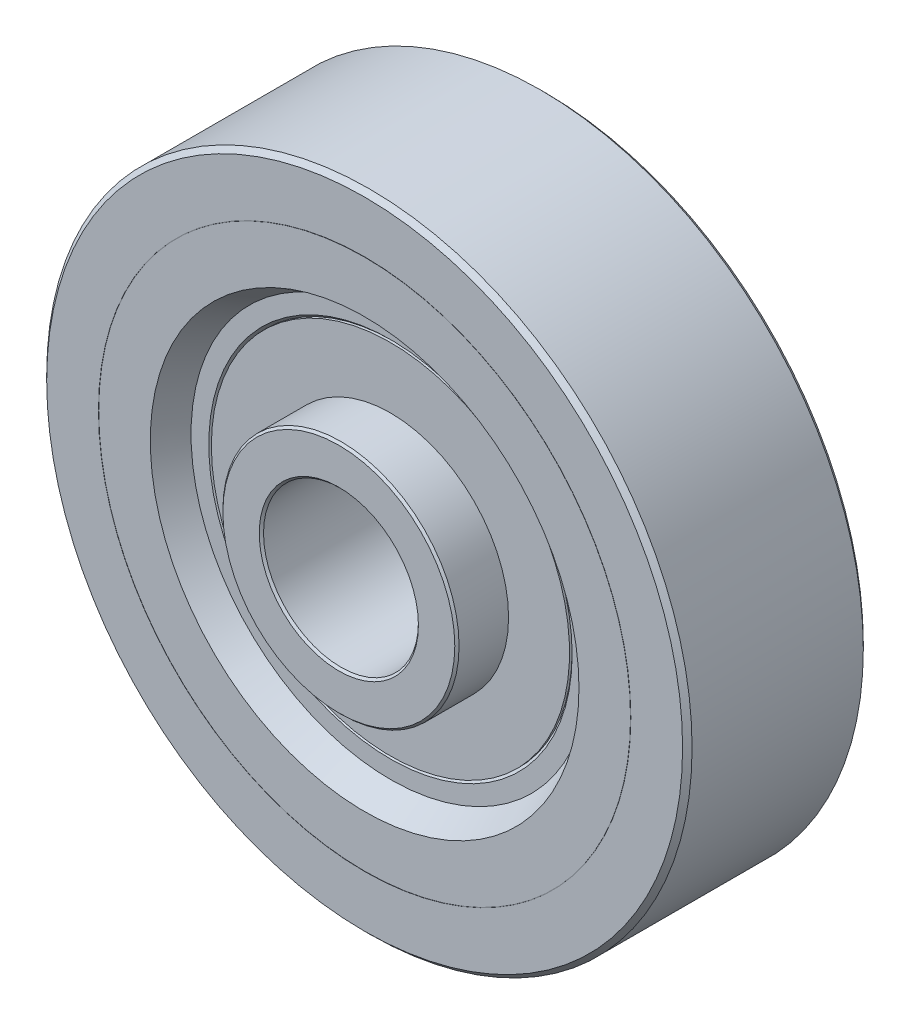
ISO-10303-21;
HEADER;
FILE_DESCRIPTION(('STEP AP214'),'2;1');
FILE_NAME('part.step','',(''),(''),'','','');
FILE_SCHEMA(('AUTOMOTIVE_DESIGN { 1 0 10303 214 1 1 1 1 }'));
ENDSEC;
DATA;
#1=APPLICATION_CONTEXT('core data for automotive mechanical design processes');
#2=APPLICATION_PROTOCOL_DEFINITION('international standard','automotive_design',2000,#1);
#3=PRODUCT_CONTEXT('',#1,'mechanical');
#4=PRODUCT('Part','Part','',(#3));
#5=PRODUCT_RELATED_PRODUCT_CATEGORY('part','',(#4));
#6=PRODUCT_DEFINITION_FORMATION('','',#4);
#7=PRODUCT_DEFINITION_CONTEXT('part definition',#1,'design');
#8=PRODUCT_DEFINITION('design','',#6,#7);
#9=PRODUCT_DEFINITION_SHAPE('','',#8);
#10=(LENGTH_UNIT() NAMED_UNIT(*) SI_UNIT(.MILLI.,.METRE.));
#11=(NAMED_UNIT(*) PLANE_ANGLE_UNIT() SI_UNIT($,.RADIAN.));
#12=(NAMED_UNIT(*) SI_UNIT($,.STERADIAN.) SOLID_ANGLE_UNIT());
#13=UNCERTAINTY_MEASURE_WITH_UNIT(LENGTH_MEASURE(1.E-05),#10,'distance_accuracy_value','');
#14=(GEOMETRIC_REPRESENTATION_CONTEXT(3) GLOBAL_UNCERTAINTY_ASSIGNED_CONTEXT((#13)) GLOBAL_UNIT_ASSIGNED_CONTEXT((#10,
#11,#12)) REPRESENTATION_CONTEXT('',''));
#15=CARTESIAN_POINT('',(0.,0.,0.));
#16=DIRECTION('',(0.,0.,1.));
#17=DIRECTION('',(1.,0.,0.));
#18=AXIS2_PLACEMENT_3D('',#15,#16,#17);
#19=CARTESIAN_POINT('',(0.,0.,4.375));
#20=DIRECTION('',(0.,0.,-1.));
#21=DIRECTION('',(-1.,0.,0.));
#22=AXIS2_PLACEMENT_3D('',#19,#20,#21);
#23=CYLINDRICAL_SURFACE('',#22,13.875);
#24=CARTESIAN_POINT('',(0.,0.,5.));
#25=DIRECTION('',(0.,0.,-1.));
#26=DIRECTION('',(-1.,0.,0.));
#27=AXIS2_PLACEMENT_3D('',#24,#25,#26);
#28=CIRCLE('',#27,13.875);
#29=CARTESIAN_POINT('',(-13.875,0.,5.));
#30=VERTEX_POINT('',#29);
#31=EDGE_CURVE('E96',#30,#30,#28,.F.);
#32=ORIENTED_EDGE('',*,*,#31,.F.);
#33=EDGE_LOOP('',(#32));
#34=FACE_BOUND('',#33,.T.);
#35=CARTESIAN_POINT('',(0.,0.,4.8));
#36=DIRECTION('',(0.,0.,1.));
#37=DIRECTION('',(0.,1.,0.));
#38=AXIS2_PLACEMENT_3D('',#35,#36,#37);
#39=CIRCLE('',#38,13.875);
#40=CARTESIAN_POINT('',(0.,13.875,4.8));
#41=VERTEX_POINT('',#40);
#42=EDGE_CURVE('E32',#41,#41,#39,.T.);
#43=ORIENTED_EDGE('',*,*,#42,.T.);
#44=EDGE_LOOP('',(#43));
#45=FACE_BOUND('',#44,.T.);
#46=ADVANCED_FACE('F12',(#34,#45),#23,.T.);
#47=CARTESIAN_POINT('',(0.,11.5125,5.));
#48=DIRECTION('',(0.,0.,1.));
#49=DIRECTION('',(1.,0.,0.));
#50=AXIS2_PLACEMENT_3D('',#47,#48,#49);
#51=PLANE('',#50);
#52=ORIENTED_EDGE('',*,*,#31,.T.);
#53=EDGE_LOOP('',(#52));
#54=FACE_BOUND('',#53,.T.);
#55=CARTESIAN_POINT('',(0.,0.,5.));
#56=DIRECTION('',(0.,0.,1.));
#57=DIRECTION('',(1.,0.,0.));
#58=AXIS2_PLACEMENT_3D('',#55,#56,#57);
#59=CIRCLE('',#58,9.15);
#60=CARTESIAN_POINT('',(9.15,0.,5.));
#61=VERTEX_POINT('',#60);
#62=EDGE_CURVE('E35',#61,#61,#59,.F.);
#63=ORIENTED_EDGE('',*,*,#62,.T.);
#64=EDGE_LOOP('',(#63));
#65=FACE_BOUND('',#64,.T.);
#66=ADVANCED_FACE('F172',(#54,#65),#51,.T.);
#67=CARTESIAN_POINT('',(0.,0.,4.9889236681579));
#68=DIRECTION('',(0.,0.,-1.));
#69=DIRECTION('',(-1.,0.,0.));
#70=AXIS2_PLACEMENT_3D('',#67,#68,#69);
#71=CYLINDRICAL_SURFACE('',#70,9.15);
#72=CARTESIAN_POINT('',(0.,0.,8.83363636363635));
#73=DIRECTION('',(0.,0.,-1.));
#74=DIRECTION('',(0.,1.,0.));
#75=AXIS2_PLACEMENT_3D('',#72,#73,#74);
#76=CIRCLE('',#75,9.15);
#77=CARTESIAN_POINT('',(0.,9.15,8.83363636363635));
#78=VERTEX_POINT('',#77);
#79=EDGE_CURVE('E93',#78,#78,#76,.F.);
#80=ORIENTED_EDGE('',*,*,#79,.F.);
#81=EDGE_LOOP('',(#80));
#82=FACE_BOUND('',#81,.T.);
#83=ORIENTED_EDGE('',*,*,#62,.F.);
#84=EDGE_LOOP('',(#83));
#85=FACE_BOUND('',#84,.T.);
#86=ADVANCED_FACE('F167',(#82,#85),#71,.T.);
#87=CARTESIAN_POINT('',(0.,0.,8.83363636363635));
#88=DIRECTION('',(0.,0.,-1.));
#89=DIRECTION('',(-1.,0.,0.));
#90=AXIS2_PLACEMENT_3D('',#87,#88,#89);
#91=CONICAL_SURFACE('',#90,9.15,0.785398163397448);
#92=CARTESIAN_POINT('',(0.,0.,9.));
#93=DIRECTION('',(0.,0.,-1.));
#94=DIRECTION('',(-1.,0.,0.));
#95=AXIS2_PLACEMENT_3D('',#92,#93,#94);
#96=CIRCLE('',#95,8.98363636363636);
#97=CARTESIAN_POINT('',(-8.98363636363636,0.,9.));
#98=VERTEX_POINT('',#97);
#99=EDGE_CURVE('E92',#98,#98,#96,.F.);
#100=ORIENTED_EDGE('',*,*,#99,.F.);
#101=EDGE_LOOP('',(#100));
#102=FACE_BOUND('',#101,.T.);
#103=ORIENTED_EDGE('',*,*,#79,.T.);
#104=EDGE_LOOP('',(#103));
#105=FACE_BOUND('',#104,.T.);
#106=ADVANCED_FACE('F161',(#102,#105),#91,.T.);
#107=CARTESIAN_POINT('',(0.,7.575,9.));
#108=DIRECTION('',(0.,0.,1.));
#109=DIRECTION('',(1.,0.,0.));
#110=AXIS2_PLACEMENT_3D('',#107,#108,#109);
#111=PLANE('',#110);
#112=ORIENTED_EDGE('',*,*,#99,.T.);
#113=EDGE_LOOP('',(#112));
#114=FACE_BOUND('',#113,.T.);
#115=CARTESIAN_POINT('',(0.,0.,9.00000000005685));
#116=DIRECTION('',(0.,0.,1.));
#117=DIRECTION('',(1.,0.,0.));
#118=AXIS2_PLACEMENT_3D('',#115,#116,#117);
#119=CIRCLE('',#118,6.16636363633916);
#120=CARTESIAN_POINT('',(6.16636363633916,0.,9.00000000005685));
#121=VERTEX_POINT('',#120);
#122=EDGE_CURVE('E99',#121,#121,#119,.F.);
#123=ORIENTED_EDGE('',*,*,#122,.T.);
#124=EDGE_LOOP('',(#123));
#125=FACE_BOUND('',#124,.T.);
#126=ADVANCED_FACE('F154',(#114,#125),#111,.T.);
#127=CARTESIAN_POINT('',(0.,0.,9.00000000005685));
#128=DIRECTION('',(0.,0.,1.));
#129=DIRECTION('',(1.,0.,0.));
#130=AXIS2_PLACEMENT_3D('',#127,#128,#129);
#131=CONICAL_SURFACE('',#130,6.16636363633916,0.785398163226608);
#132=CARTESIAN_POINT('',(0.,0.,8.83363636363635));
#133=DIRECTION('',(0.,0.,-1.));
#134=DIRECTION('',(-1.,0.,0.));
#135=AXIS2_PLACEMENT_3D('',#132,#133,#134);
#136=CIRCLE('',#135,6.);
#137=CARTESIAN_POINT('',(-6.,0.,8.83363636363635));
#138=VERTEX_POINT('',#137);
#139=EDGE_CURVE('E82',#138,#138,#136,.T.);
#140=ORIENTED_EDGE('',*,*,#139,.T.);
#141=EDGE_LOOP('',(#140));
#142=FACE_BOUND('',#141,.T.);
#143=ORIENTED_EDGE('',*,*,#122,.F.);
#144=EDGE_LOOP('',(#143));
#145=FACE_BOUND('',#144,.T.);
#146=ADVANCED_FACE('F128',(#142,#145),#131,.F.);
#147=CARTESIAN_POINT('',(0.,0.,-4.375));
#148=DIRECTION('',(0.,0.,-1.));
#149=DIRECTION('',(-1.,0.,0.));
#150=AXIS2_PLACEMENT_3D('',#147,#148,#149);
#151=CYLINDRICAL_SURFACE('',#150,13.875);
#152=CARTESIAN_POINT('',(0.,0.,-4.8));
#153=DIRECTION('',(0.,0.,-1.));
#154=DIRECTION('',(0.,1.,0.));
#155=AXIS2_PLACEMENT_3D('',#152,#153,#154);
#156=CIRCLE('',#155,13.875);
#157=CARTESIAN_POINT('',(0.,13.875,-4.8));
#158=VERTEX_POINT('',#157);
#159=EDGE_CURVE('E28',#158,#158,#156,.T.);
#160=ORIENTED_EDGE('',*,*,#159,.T.);
#161=EDGE_LOOP('',(#160));
#162=FACE_BOUND('',#161,.T.);
#163=CARTESIAN_POINT('',(0.,0.,-5.));
#164=DIRECTION('',(0.,0.,-1.));
#165=DIRECTION('',(-1.,0.,0.));
#166=AXIS2_PLACEMENT_3D('',#163,#164,#165);
#167=CIRCLE('',#166,13.875);
#168=CARTESIAN_POINT('',(-13.875,0.,-5.));
#169=VERTEX_POINT('',#168);
#170=EDGE_CURVE('E110',#169,#169,#167,.F.);
#171=ORIENTED_EDGE('',*,*,#170,.T.);
#172=EDGE_LOOP('',(#171));
#173=FACE_BOUND('',#172,.T.);
#174=ADVANCED_FACE('F114',(#162,#173),#151,.T.);
#175=CARTESIAN_POINT('',(0.,11.5125,-5.));
#176=DIRECTION('',(0.,0.,-1.));
#177=DIRECTION('',(-1.,0.,0.));
#178=AXIS2_PLACEMENT_3D('',#175,#176,#177);
#179=PLANE('',#178);
#180=CARTESIAN_POINT('',(0.,0.,-5.));
#181=DIRECTION('',(0.,0.,-1.));
#182=DIRECTION('',(-1.,0.,0.));
#183=AXIS2_PLACEMENT_3D('',#180,#181,#182);
#184=CIRCLE('',#183,9.15);
#185=CARTESIAN_POINT('',(-9.15,0.,-5.));
#186=VERTEX_POINT('',#185);
#187=EDGE_CURVE('E16',#186,#186,#184,.F.);
#188=ORIENTED_EDGE('',*,*,#187,.T.);
#189=EDGE_LOOP('',(#188));
#190=FACE_BOUND('',#189,.T.);
#191=ORIENTED_EDGE('',*,*,#170,.F.);
#192=EDGE_LOOP('',(#191));
#193=FACE_BOUND('',#192,.T.);
#194=ADVANCED_FACE('F14',(#190,#193),#179,.T.);
#195=CARTESIAN_POINT('',(0.,0.,-4.9889236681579));
#196=DIRECTION('',(0.,0.,-1.));
#197=DIRECTION('',(-1.,0.,0.));
#198=AXIS2_PLACEMENT_3D('',#195,#196,#197);
#199=CYLINDRICAL_SURFACE('',#198,9.15);
#200=ORIENTED_EDGE('',*,*,#187,.F.);
#201=EDGE_LOOP('',(#200));
#202=FACE_BOUND('',#201,.T.);
#203=CARTESIAN_POINT('',(0.,0.,-8.83363636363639));
#204=DIRECTION('',(0.,0.,1.));
#205=DIRECTION('',(0.,1.,0.));
#206=AXIS2_PLACEMENT_3D('',#203,#204,#205);
#207=CIRCLE('',#206,9.15);
#208=CARTESIAN_POINT('',(0.,9.15,-8.83363636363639));
#209=VERTEX_POINT('',#208);
#210=EDGE_CURVE('E89',#209,#209,#207,.F.);
#211=ORIENTED_EDGE('',*,*,#210,.F.);
#212=EDGE_LOOP('',(#211));
#213=FACE_BOUND('',#212,.T.);
#214=ADVANCED_FACE('F117',(#202,#213),#199,.T.);
#215=CARTESIAN_POINT('',(0.,0.,-8.83363636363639));
#216=DIRECTION('',(0.,0.,1.));
#217=DIRECTION('',(1.,0.,0.));
#218=AXIS2_PLACEMENT_3D('',#215,#216,#217);
#219=CONICAL_SURFACE('',#218,9.15,0.785398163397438);
#220=ORIENTED_EDGE('',*,*,#210,.T.);
#221=EDGE_LOOP('',(#220));
#222=FACE_BOUND('',#221,.T.);
#223=CARTESIAN_POINT('',(0.,0.,-9.));
#224=DIRECTION('',(0.,0.,1.));
#225=DIRECTION('',(1.,0.,0.));
#226=AXIS2_PLACEMENT_3D('',#223,#224,#225);
#227=CIRCLE('',#226,8.98363636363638);
#228=CARTESIAN_POINT('',(8.98363636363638,0.,-9.));
#229=VERTEX_POINT('',#228);
#230=EDGE_CURVE('E102',#229,#229,#227,.F.);
#231=ORIENTED_EDGE('',*,*,#230,.F.);
#232=EDGE_LOOP('',(#231));
#233=FACE_BOUND('',#232,.T.);
#234=ADVANCED_FACE('F125',(#222,#233),#219,.T.);
#235=CARTESIAN_POINT('',(0.,7.575,-9.));
#236=DIRECTION('',(0.,0.,-1.));
#237=DIRECTION('',(-1.,0.,0.));
#238=AXIS2_PLACEMENT_3D('',#235,#236,#237);
#239=PLANE('',#238);
#240=CARTESIAN_POINT('',(0.,0.,-9.0000000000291));
#241=DIRECTION('',(0.,0.,-1.));
#242=DIRECTION('',(-1.,0.,0.));
#243=AXIS2_PLACEMENT_3D('',#240,#241,#242);
#244=CIRCLE('',#243,6.16636363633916);
#245=CARTESIAN_POINT('',(-6.16636363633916,0.,-9.0000000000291));
#246=VERTEX_POINT('',#245);
#247=EDGE_CURVE('E86',#246,#246,#244,.F.);
#248=ORIENTED_EDGE('',*,*,#247,.T.);
#249=EDGE_LOOP('',(#248));
#250=FACE_BOUND('',#249,.T.);
#251=ORIENTED_EDGE('',*,*,#230,.T.);
#252=EDGE_LOOP('',(#251));
#253=FACE_BOUND('',#252,.T.);
#254=ADVANCED_FACE('F145',(#250,#253),#239,.T.);
#255=CARTESIAN_POINT('',(0.,0.,-8.99999999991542));
#256=DIRECTION('',(0.,0.,-1.));
#257=DIRECTION('',(-1.,0.,0.));
#258=AXIS2_PLACEMENT_3D('',#255,#256,#257);
#259=CONICAL_SURFACE('',#258,6.16636363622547,0.785398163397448);
#260=ORIENTED_EDGE('',*,*,#247,.F.);
#261=EDGE_LOOP('',(#260));
#262=FACE_BOUND('',#261,.T.);
#263=CARTESIAN_POINT('',(0.,0.,-8.8336363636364));
#264=DIRECTION('',(0.,0.,-1.));
#265=DIRECTION('',(-1.,0.,0.));
#266=AXIS2_PLACEMENT_3D('',#263,#264,#265);
#267=CIRCLE('',#266,6.);
#268=CARTESIAN_POINT('',(-6.,0.,-8.8336363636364));
#269=VERTEX_POINT('',#268);
#270=EDGE_CURVE('E85',#269,#269,#267,.F.);
#271=ORIENTED_EDGE('',*,*,#270,.T.);
#272=EDGE_LOOP('',(#271));
#273=FACE_BOUND('',#272,.T.);
#274=ADVANCED_FACE('F134',(#262,#273),#259,.F.);
#275=CARTESIAN_POINT('',(0.,0.,0.));
#276=DIRECTION('',(0.,0.,-1.));
#277=DIRECTION('',(-1.,0.,0.));
#278=AXIS2_PLACEMENT_3D('',#275,#276,#277);
#279=CYLINDRICAL_SURFACE('',#278,6.);
#280=ORIENTED_EDGE('',*,*,#270,.F.);
#281=EDGE_LOOP('',(#280));
#282=FACE_BOUND('',#281,.T.);
#283=ORIENTED_EDGE('',*,*,#139,.F.);
#284=EDGE_LOOP('',(#283));
#285=FACE_BOUND('',#284,.T.);
#286=ADVANCED_FACE('F131',(#282,#285),#279,.F.);
#287=CARTESIAN_POINT('',(0.,0.,5.));
#288=DIRECTION('',(0.,0.,1.));
#289=DIRECTION('',(1.,0.,0.));
#290=AXIS2_PLACEMENT_3D('',#287,#288,#289);
#291=CONICAL_SURFACE('',#290,14.075,0.785398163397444);
#292=ORIENTED_EDGE('',*,*,#42,.F.);
#293=EDGE_LOOP('',(#292));
#294=FACE_BOUND('',#293,.T.);
#295=CARTESIAN_POINT('',(0.,0.,5.));
#296=DIRECTION('',(0.,0.,1.));
#297=DIRECTION('',(1.,0.,0.));
#298=AXIS2_PLACEMENT_3D('',#295,#296,#297);
#299=CIRCLE('',#298,14.075);
#300=CARTESIAN_POINT('',(14.075,0.,5.));
#301=VERTEX_POINT('',#300);
#302=EDGE_CURVE('E31',#301,#301,#299,.F.);
#303=ORIENTED_EDGE('',*,*,#302,.F.);
#304=EDGE_LOOP('',(#303));
#305=FACE_BOUND('',#304,.T.);
#306=ADVANCED_FACE('F133',(#294,#305),#291,.F.);
#307=CARTESIAN_POINT('',(0.,14.7625,5.));
#308=DIRECTION('',(0.,0.,1.));
#309=DIRECTION('',(1.,0.,0.));
#310=AXIS2_PLACEMENT_3D('',#307,#308,#309);
#311=PLANE('',#310);
#312=CARTESIAN_POINT('',(0.,0.,5.));
#313=DIRECTION('',(0.,0.,1.));
#314=DIRECTION('',(1.,0.,0.));
#315=AXIS2_PLACEMENT_3D('',#312,#313,#314);
#316=CIRCLE('',#315,15.45);
#317=CARTESIAN_POINT('',(15.45,0.,5.));
#318=VERTEX_POINT('',#317);
#319=EDGE_CURVE('E74',#318,#318,#316,.T.);
#320=ORIENTED_EDGE('',*,*,#319,.T.);
#321=EDGE_LOOP('',(#320));
#322=FACE_BOUND('',#321,.T.);
#323=ORIENTED_EDGE('',*,*,#302,.T.);
#324=EDGE_LOOP('',(#323));
#325=FACE_BOUND('',#324,.T.);
#326=ADVANCED_FACE('F142',(#322,#325),#311,.T.);
#327=CARTESIAN_POINT('',(0.,0.,7.));
#328=DIRECTION('',(0.,0.,1.));
#329=DIRECTION('',(1.,0.,0.));
#330=AXIS2_PLACEMENT_3D('',#327,#328,#329);
#331=CONICAL_SURFACE('',#330,16.6047005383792,0.523598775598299);
#332=ORIENTED_EDGE('',*,*,#319,.F.);
#333=EDGE_LOOP('',(#332));
#334=FACE_BOUND('',#333,.T.);
#335=CARTESIAN_POINT('',(0.,0.,7.));
#336=DIRECTION('',(0.,0.,1.));
#337=DIRECTION('',(1.,0.,0.));
#338=AXIS2_PLACEMENT_3D('',#335,#336,#337);
#339=CIRCLE('',#338,16.6047005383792);
#340=CARTESIAN_POINT('',(16.6047005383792,0.,7.));
#341=VERTEX_POINT('',#340);
#342=EDGE_CURVE('E68',#341,#341,#339,.F.);
#343=ORIENTED_EDGE('',*,*,#342,.F.);
#344=EDGE_LOOP('',(#343));
#345=FACE_BOUND('',#344,.T.);
#346=ADVANCED_FACE('F241',(#334,#345),#331,.F.);
#347=CARTESIAN_POINT('',(0.,18.6026002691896,7.));
#348=DIRECTION('',(0.,0.,1.));
#349=DIRECTION('',(1.,0.,0.));
#350=AXIS2_PLACEMENT_3D('',#347,#348,#349);
#351=PLANE('',#350);
#352=CARTESIAN_POINT('',(0.,0.,7.));
#353=DIRECTION('',(0.,0.,-1.));
#354=DIRECTION('',(-1.,0.,0.));
#355=AXIS2_PLACEMENT_3D('',#352,#353,#354);
#356=CIRCLE('',#355,20.6005);
#357=CARTESIAN_POINT('',(-20.6005,0.,7.));
#358=VERTEX_POINT('',#357);
#359=EDGE_CURVE('E62',#358,#358,#356,.T.);
#360=ORIENTED_EDGE('',*,*,#359,.F.);
#361=EDGE_LOOP('',(#360));
#362=FACE_BOUND('',#361,.T.);
#363=ORIENTED_EDGE('',*,*,#342,.T.);
#364=EDGE_LOOP('',(#363));
#365=FACE_BOUND('',#364,.T.);
#366=ADVANCED_FACE('F233',(#362,#365),#351,.T.);
#367=CARTESIAN_POINT('',(0.,0.,6.99));
#368=DIRECTION('',(0.,0.,-1.));
#369=DIRECTION('',(-1.,0.,0.));
#370=AXIS2_PLACEMENT_3D('',#367,#368,#369);
#371=CYLINDRICAL_SURFACE('',#370,20.6005);
#372=ORIENTED_EDGE('',*,*,#359,.T.);
#373=EDGE_LOOP('',(#372));
#374=FACE_BOUND('',#373,.T.);
#375=CARTESIAN_POINT('',(0.,0.,6.98));
#376=DIRECTION('',(0.,0.,-1.));
#377=DIRECTION('',(-1.,0.,0.));
#378=AXIS2_PLACEMENT_3D('',#375,#376,#377);
#379=CIRCLE('',#378,20.6005);
#380=CARTESIAN_POINT('',(-20.6005,0.,6.98));
#381=VERTEX_POINT('',#380);
#382=EDGE_CURVE('E56',#381,#381,#379,.T.);
#383=ORIENTED_EDGE('',*,*,#382,.F.);
#384=EDGE_LOOP('',(#383));
#385=FACE_BOUND('',#384,.T.);
#386=ADVANCED_FACE('F225',(#374,#385),#371,.T.);
#387=CARTESIAN_POINT('',(0.,20.6105,6.98));
#388=DIRECTION('',(0.,0.,1.));
#389=DIRECTION('',(1.,0.,0.));
#390=AXIS2_PLACEMENT_3D('',#387,#388,#389);
#391=PLANE('',#390);
#392=CARTESIAN_POINT('',(0.,0.,6.98));
#393=DIRECTION('',(0.,0.,-1.));
#394=DIRECTION('',(-1.,0.,0.));
#395=AXIS2_PLACEMENT_3D('',#392,#393,#394);
#396=CIRCLE('',#395,20.6205);
#397=CARTESIAN_POINT('',(-20.6205,0.,6.98));
#398=VERTEX_POINT('',#397);
#399=EDGE_CURVE('E50',#398,#398,#396,.F.);
#400=ORIENTED_EDGE('',*,*,#399,.T.);
#401=EDGE_LOOP('',(#400));
#402=FACE_BOUND('',#401,.T.);
#403=ORIENTED_EDGE('',*,*,#382,.T.);
#404=EDGE_LOOP('',(#403));
#405=FACE_BOUND('',#404,.T.);
#406=ADVANCED_FACE('F217',(#402,#405),#391,.T.);
#407=CARTESIAN_POINT('',(0.,0.,6.99));
#408=DIRECTION('',(0.,0.,-1.));
#409=DIRECTION('',(-1.,0.,0.));
#410=AXIS2_PLACEMENT_3D('',#407,#408,#409);
#411=CYLINDRICAL_SURFACE('',#410,20.6205);
#412=ORIENTED_EDGE('',*,*,#399,.F.);
#413=EDGE_LOOP('',(#412));
#414=FACE_BOUND('',#413,.T.);
#415=CARTESIAN_POINT('',(0.,0.,7.));
#416=DIRECTION('',(0.,0.,-1.));
#417=DIRECTION('',(-1.,0.,0.));
#418=AXIS2_PLACEMENT_3D('',#415,#416,#417);
#419=CIRCLE('',#418,20.6205);
#420=CARTESIAN_POINT('',(-20.6205,0.,7.));
#421=VERTEX_POINT('',#420);
#422=EDGE_CURVE('E44',#421,#421,#419,.T.);
#423=ORIENTED_EDGE('',*,*,#422,.F.);
#424=EDGE_LOOP('',(#423));
#425=FACE_BOUND('',#424,.T.);
#426=ADVANCED_FACE('F209',(#414,#425),#411,.F.);
#427=CARTESIAN_POINT('',(0.,22.6264264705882,7.));
#428=DIRECTION('',(0.,0.,1.));
#429=DIRECTION('',(1.,0.,0.));
#430=AXIS2_PLACEMENT_3D('',#427,#428,#429);
#431=PLANE('',#430);
#432=CARTESIAN_POINT('',(0.,0.,7.));
#433=DIRECTION('',(0.,0.,-1.));
#434=DIRECTION('',(-1.,0.,0.));
#435=AXIS2_PLACEMENT_3D('',#432,#433,#434);
#436=CIRCLE('',#435,24.6323529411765);
#437=CARTESIAN_POINT('',(-24.6323529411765,0.,7.));
#438=VERTEX_POINT('',#437);
#439=EDGE_CURVE('E38',#438,#438,#436,.T.);
#440=ORIENTED_EDGE('',*,*,#439,.F.);
#441=EDGE_LOOP('',(#440));
#442=FACE_BOUND('',#441,.T.);
#443=ORIENTED_EDGE('',*,*,#422,.T.);
#444=EDGE_LOOP('',(#443));
#445=FACE_BOUND('',#444,.T.);
#446=ADVANCED_FACE('F201',(#442,#445),#431,.T.);
#447=CARTESIAN_POINT('',(0.,0.,6.63235294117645));
#448=DIRECTION('',(0.,0.,-1.));
#449=DIRECTION('',(-1.,0.,0.));
#450=AXIS2_PLACEMENT_3D('',#447,#448,#449);
#451=CONICAL_SURFACE('',#450,25.,0.785398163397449);
#452=ORIENTED_EDGE('',*,*,#439,.T.);
#453=EDGE_LOOP('',(#452));
#454=FACE_BOUND('',#453,.T.);
#455=CARTESIAN_POINT('',(0.,0.,6.63235294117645));
#456=DIRECTION('',(0.,0.,-1.));
#457=DIRECTION('',(-1.,0.,0.));
#458=AXIS2_PLACEMENT_3D('',#455,#456,#457);
#459=CIRCLE('',#458,25.);
#460=CARTESIAN_POINT('',(-25.,0.,6.63235294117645));
#461=VERTEX_POINT('',#460);
#462=EDGE_CURVE('E20',#461,#461,#459,.T.);
#463=ORIENTED_EDGE('',*,*,#462,.F.);
#464=EDGE_LOOP('',(#463));
#465=FACE_BOUND('',#464,.T.);
#466=ADVANCED_FACE('F197',(#454,#465),#451,.T.);
#467=CARTESIAN_POINT('',(0.,0.,-5.));
#468=DIRECTION('',(0.,0.,-1.));
#469=DIRECTION('',(-1.,0.,0.));
#470=AXIS2_PLACEMENT_3D('',#467,#468,#469);
#471=CONICAL_SURFACE('',#470,14.075,0.785398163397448);
#472=CARTESIAN_POINT('',(0.,0.,-5.));
#473=DIRECTION('',(0.,0.,-1.));
#474=DIRECTION('',(-1.,0.,0.));
#475=AXIS2_PLACEMENT_3D('',#472,#473,#474);
#476=CIRCLE('',#475,14.075);
#477=CARTESIAN_POINT('',(-14.075,0.,-5.));
#478=VERTEX_POINT('',#477);
#479=EDGE_CURVE('E77',#478,#478,#476,.F.);
#480=ORIENTED_EDGE('',*,*,#479,.F.);
#481=EDGE_LOOP('',(#480));
#482=FACE_BOUND('',#481,.T.);
#483=ORIENTED_EDGE('',*,*,#159,.F.);
#484=EDGE_LOOP('',(#483));
#485=FACE_BOUND('',#484,.T.);
#486=ADVANCED_FACE('F200',(#482,#485),#471,.F.);
#487=CARTESIAN_POINT('',(0.,14.7625,-5.));
#488=DIRECTION('',(0.,0.,-1.));
#489=DIRECTION('',(-1.,0.,0.));
#490=AXIS2_PLACEMENT_3D('',#487,#488,#489);
#491=PLANE('',#490);
#492=ORIENTED_EDGE('',*,*,#479,.T.);
#493=EDGE_LOOP('',(#492));
#494=FACE_BOUND('',#493,.T.);
#495=CARTESIAN_POINT('',(0.,0.,-5.));
#496=DIRECTION('',(0.,0.,-1.));
#497=DIRECTION('',(-1.,0.,0.));
#498=AXIS2_PLACEMENT_3D('',#495,#496,#497);
#499=CIRCLE('',#498,15.45);
#500=CARTESIAN_POINT('',(-15.45,0.,-5.));
#501=VERTEX_POINT('',#500);
#502=EDGE_CURVE('E71',#501,#501,#499,.T.);
#503=ORIENTED_EDGE('',*,*,#502,.T.);
#504=EDGE_LOOP('',(#503));
#505=FACE_BOUND('',#504,.T.);
#506=ADVANCED_FACE('F245',(#494,#505),#491,.T.);
#507=CARTESIAN_POINT('',(0.,0.,-7.));
#508=DIRECTION('',(0.,0.,-1.));
#509=DIRECTION('',(-1.,0.,0.));
#510=AXIS2_PLACEMENT_3D('',#507,#508,#509);
#511=CONICAL_SURFACE('',#510,16.6047005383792,0.523598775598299);
#512=CARTESIAN_POINT('',(0.,0.,-7.));
#513=DIRECTION('',(0.,0.,-1.));
#514=DIRECTION('',(-1.,0.,0.));
#515=AXIS2_PLACEMENT_3D('',#512,#513,#514);
#516=CIRCLE('',#515,16.6047005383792);
#517=CARTESIAN_POINT('',(-16.6047005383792,0.,-7.));
#518=VERTEX_POINT('',#517);
#519=EDGE_CURVE('E65',#518,#518,#516,.F.);
#520=ORIENTED_EDGE('',*,*,#519,.F.);
#521=EDGE_LOOP('',(#520));
#522=FACE_BOUND('',#521,.T.);
#523=ORIENTED_EDGE('',*,*,#502,.F.);
#524=EDGE_LOOP('',(#523));
#525=FACE_BOUND('',#524,.T.);
#526=ADVANCED_FACE('F237',(#522,#525),#511,.F.);
#527=CARTESIAN_POINT('',(0.,18.6026002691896,-7.));
#528=DIRECTION('',(0.,0.,-1.));
#529=DIRECTION('',(-1.,0.,0.));
#530=AXIS2_PLACEMENT_3D('',#527,#528,#529);
#531=PLANE('',#530);
#532=ORIENTED_EDGE('',*,*,#519,.T.);
#533=EDGE_LOOP('',(#532));
#534=FACE_BOUND('',#533,.T.);
#535=CARTESIAN_POINT('',(0.,0.,-7.));
#536=DIRECTION('',(0.,0.,-1.));
#537=DIRECTION('',(-1.,0.,0.));
#538=AXIS2_PLACEMENT_3D('',#535,#536,#537);
#539=CIRCLE('',#538,20.6005);
#540=CARTESIAN_POINT('',(-20.6005,0.,-7.));
#541=VERTEX_POINT('',#540);
#542=EDGE_CURVE('E59',#541,#541,#539,.F.);
#543=ORIENTED_EDGE('',*,*,#542,.F.);
#544=EDGE_LOOP('',(#543));
#545=FACE_BOUND('',#544,.T.);
#546=ADVANCED_FACE('F229',(#534,#545),#531,.T.);
#547=CARTESIAN_POINT('',(0.,0.,-6.99));
#548=DIRECTION('',(0.,0.,-1.));
#549=DIRECTION('',(-1.,0.,0.));
#550=AXIS2_PLACEMENT_3D('',#547,#548,#549);
#551=CYLINDRICAL_SURFACE('',#550,20.6005);
#552=CARTESIAN_POINT('',(0.,0.,-6.98));
#553=DIRECTION('',(0.,0.,-1.));
#554=DIRECTION('',(-1.,0.,0.));
#555=AXIS2_PLACEMENT_3D('',#552,#553,#554);
#556=CIRCLE('',#555,20.6005);
#557=CARTESIAN_POINT('',(-20.6005,0.,-6.98));
#558=VERTEX_POINT('',#557);
#559=EDGE_CURVE('E53',#558,#558,#556,.F.);
#560=ORIENTED_EDGE('',*,*,#559,.F.);
#561=EDGE_LOOP('',(#560));
#562=FACE_BOUND('',#561,.T.);
#563=ORIENTED_EDGE('',*,*,#542,.T.);
#564=EDGE_LOOP('',(#563));
#565=FACE_BOUND('',#564,.T.);
#566=ADVANCED_FACE('F221',(#562,#565),#551,.T.);
#567=CARTESIAN_POINT('',(0.,20.6105,-6.98));
#568=DIRECTION('',(0.,0.,-1.));
#569=DIRECTION('',(-1.,0.,0.));
#570=AXIS2_PLACEMENT_3D('',#567,#568,#569);
#571=PLANE('',#570);
#572=ORIENTED_EDGE('',*,*,#559,.T.);
#573=EDGE_LOOP('',(#572));
#574=FACE_BOUND('',#573,.T.);
#575=CARTESIAN_POINT('',(0.,0.,-6.98));
#576=DIRECTION('',(0.,0.,-1.));
#577=DIRECTION('',(-1.,0.,0.));
#578=AXIS2_PLACEMENT_3D('',#575,#576,#577);
#579=CIRCLE('',#578,20.6205);
#580=CARTESIAN_POINT('',(-20.6205,0.,-6.98));
#581=VERTEX_POINT('',#580);
#582=EDGE_CURVE('E47',#581,#581,#579,.T.);
#583=ORIENTED_EDGE('',*,*,#582,.T.);
#584=EDGE_LOOP('',(#583));
#585=FACE_BOUND('',#584,.T.);
#586=ADVANCED_FACE('F213',(#574,#585),#571,.T.);
#587=CARTESIAN_POINT('',(0.,0.,-6.99));
#588=DIRECTION('',(0.,0.,-1.));
#589=DIRECTION('',(-1.,0.,0.));
#590=AXIS2_PLACEMENT_3D('',#587,#588,#589);
#591=CYLINDRICAL_SURFACE('',#590,20.6205);
#592=CARTESIAN_POINT('',(0.,0.,-7.));
#593=DIRECTION('',(0.,0.,-1.));
#594=DIRECTION('',(-1.,0.,0.));
#595=AXIS2_PLACEMENT_3D('',#592,#593,#594);
#596=CIRCLE('',#595,20.6205);
#597=CARTESIAN_POINT('',(-20.6205,0.,-7.));
#598=VERTEX_POINT('',#597);
#599=EDGE_CURVE('E41',#598,#598,#596,.F.);
#600=ORIENTED_EDGE('',*,*,#599,.F.);
#601=EDGE_LOOP('',(#600));
#602=FACE_BOUND('',#601,.T.);
#603=ORIENTED_EDGE('',*,*,#582,.F.);
#604=EDGE_LOOP('',(#603));
#605=FACE_BOUND('',#604,.T.);
#606=ADVANCED_FACE('F205',(#602,#605),#591,.F.);
#607=CARTESIAN_POINT('',(0.,22.6264264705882,-7.));
#608=DIRECTION('',(0.,0.,-1.));
#609=DIRECTION('',(-1.,0.,0.));
#610=AXIS2_PLACEMENT_3D('',#607,#608,#609);
#611=PLANE('',#610);
#612=ORIENTED_EDGE('',*,*,#599,.T.);
#613=EDGE_LOOP('',(#612));
#614=FACE_BOUND('',#613,.T.);
#615=CARTESIAN_POINT('',(0.,0.,-7.));
#616=DIRECTION('',(0.,0.,1.));
#617=DIRECTION('',(1.,0.,0.));
#618=AXIS2_PLACEMENT_3D('',#615,#616,#617);
#619=CIRCLE('',#618,24.6323529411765);
#620=CARTESIAN_POINT('',(24.6323529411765,0.,-7.));
#621=VERTEX_POINT('',#620);
#622=EDGE_CURVE('E25',#621,#621,#619,.T.);
#623=ORIENTED_EDGE('',*,*,#622,.F.);
#624=EDGE_LOOP('',(#623));
#625=FACE_BOUND('',#624,.T.);
#626=ADVANCED_FACE('F193',(#614,#625),#611,.T.);
#627=CARTESIAN_POINT('',(0.,0.,-6.63235294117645));
#628=DIRECTION('',(0.,0.,1.));
#629=DIRECTION('',(1.,0.,0.));
#630=AXIS2_PLACEMENT_3D('',#627,#628,#629);
#631=CONICAL_SURFACE('',#630,25.,0.785398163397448);
#632=ORIENTED_EDGE('',*,*,#622,.T.);
#633=EDGE_LOOP('',(#632));
#634=FACE_BOUND('',#633,.T.);
#635=CARTESIAN_POINT('',(0.,0.,-6.6323529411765));
#636=DIRECTION('',(0.,0.,-1.));
#637=DIRECTION('',(-1.,0.,0.));
#638=AXIS2_PLACEMENT_3D('',#635,#636,#637);
#639=CIRCLE('',#638,25.);
#640=CARTESIAN_POINT('',(-25.,0.,-6.6323529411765));
#641=VERTEX_POINT('',#640);
#642=EDGE_CURVE('E8',#641,#641,#639,.F.);
#643=ORIENTED_EDGE('',*,*,#642,.F.);
#644=EDGE_LOOP('',(#643));
#645=FACE_BOUND('',#644,.T.);
#646=ADVANCED_FACE('F186',(#634,#645),#631,.T.);
#647=CARTESIAN_POINT('',(0.,0.,0.));
#648=DIRECTION('',(0.,0.,-1.));
#649=DIRECTION('',(-1.,0.,0.));
#650=AXIS2_PLACEMENT_3D('',#647,#648,#649);
#651=CYLINDRICAL_SURFACE('',#650,25.);
#652=ORIENTED_EDGE('',*,*,#462,.T.);
#653=EDGE_LOOP('',(#652));
#654=FACE_BOUND('',#653,.T.);
#655=ORIENTED_EDGE('',*,*,#642,.T.);
#656=EDGE_LOOP('',(#655));
#657=FACE_BOUND('',#656,.T.);
#658=ADVANCED_FACE('F179',(#654,#657),#651,.T.);
#659=CLOSED_SHELL('',(#46,#66,#86,#106,#126,#146,#174,#194,#214,#234,#254,#274,#286,#306,#326,
#346,#366,#386,#406,#426,#446,#466,#486,#506,#526,#546,#566,#586,#606,#626,#646,#658));
#660=MANIFOLD_SOLID_BREP('B1',#659);
#661=ADVANCED_BREP_SHAPE_REPRESENTATION('',(#18,#660),#14);
#662=SHAPE_DEFINITION_REPRESENTATION(#9,#661);
ENDSEC;
END-ISO-10303-21;
